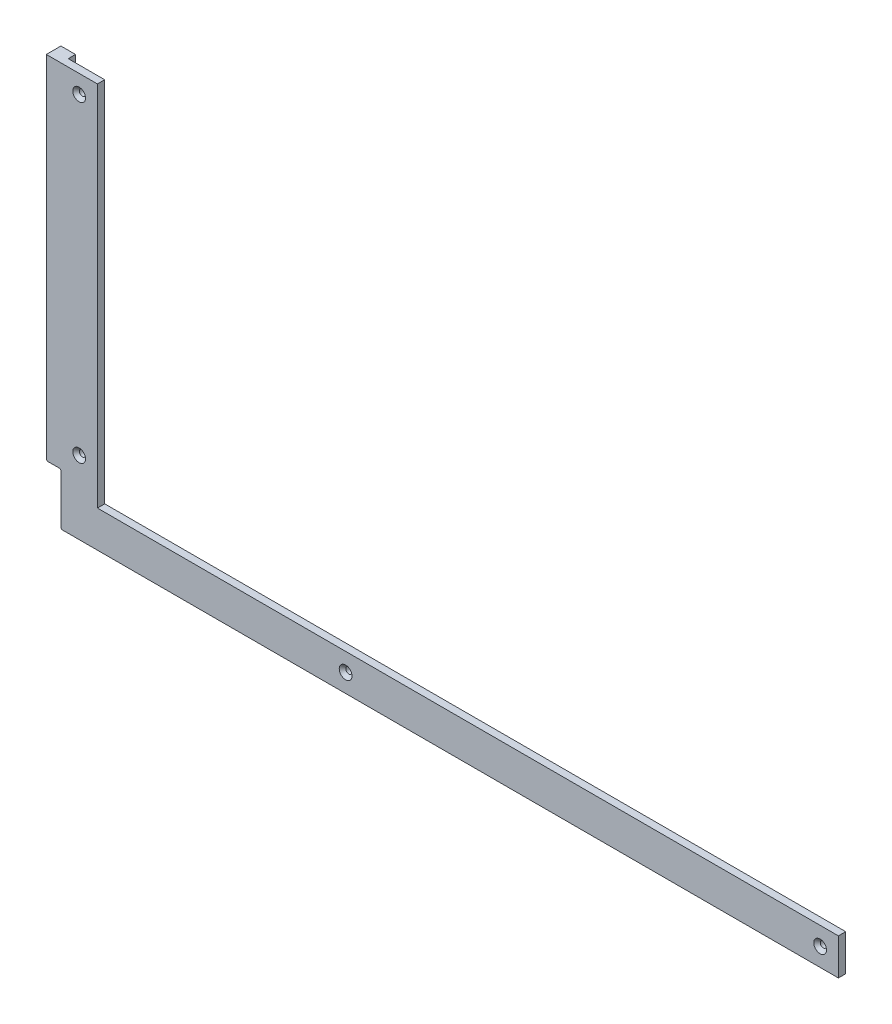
ISO-10303-21;
HEADER;
FILE_DESCRIPTION(('STEP AP214'),'2;1');
FILE_NAME('part.step','',(''),(''),'','','');
FILE_SCHEMA(('AUTOMOTIVE_DESIGN { 1 0 10303 214 1 1 1 1 }'));
ENDSEC;
DATA;
#1=APPLICATION_CONTEXT('core data for automotive mechanical design processes');
#2=APPLICATION_PROTOCOL_DEFINITION('international standard','automotive_design',2000,#1);
#3=PRODUCT_CONTEXT('',#1,'mechanical');
#4=PRODUCT('Part','Part','',(#3));
#5=PRODUCT_RELATED_PRODUCT_CATEGORY('part','',(#4));
#6=PRODUCT_DEFINITION_FORMATION('','',#4);
#7=PRODUCT_DEFINITION_CONTEXT('part definition',#1,'design');
#8=PRODUCT_DEFINITION('design','',#6,#7);
#9=PRODUCT_DEFINITION_SHAPE('','',#8);
#10=(LENGTH_UNIT() NAMED_UNIT(*) SI_UNIT(.MILLI.,.METRE.));
#11=(NAMED_UNIT(*) PLANE_ANGLE_UNIT() SI_UNIT($,.RADIAN.));
#12=(NAMED_UNIT(*) SI_UNIT($,.STERADIAN.) SOLID_ANGLE_UNIT());
#13=UNCERTAINTY_MEASURE_WITH_UNIT(LENGTH_MEASURE(1.E-05),#10,'distance_accuracy_value','');
#14=(GEOMETRIC_REPRESENTATION_CONTEXT(3) GLOBAL_UNCERTAINTY_ASSIGNED_CONTEXT((#13)) GLOBAL_UNIT_ASSIGNED_CONTEXT((#10,
#11,#12)) REPRESENTATION_CONTEXT('',''));
#15=CARTESIAN_POINT('',(0.,0.,0.));
#16=DIRECTION('',(0.,0.,1.));
#17=DIRECTION('',(1.,0.,0.));
#18=AXIS2_PLACEMENT_3D('',#15,#16,#17);
#19=CARTESIAN_POINT('',(0.,0.,8.));
#20=DIRECTION('',(0.,0.,-1.));
#21=DIRECTION('',(-1.,0.,0.));
#22=AXIS2_PLACEMENT_3D('',#19,#20,#21);
#23=PLANE('',#22);
#24=CARTESIAN_POINT('',(0.,-201.25,8.));
#25=DIRECTION('',(0.,0.,1.));
#26=DIRECTION('',(1.,0.,0.));
#27=AXIS2_PLACEMENT_3D('',#24,#25,#26);
#28=CIRCLE('',#27,3.5);
#29=CARTESIAN_POINT('',(3.5,-201.25,8.));
#30=VERTEX_POINT('',#29);
#31=EDGE_CURVE('E284',#30,#30,#28,.T.);
#32=ORIENTED_EDGE('',*,*,#31,.F.);
#33=EDGE_LOOP('',(#32));
#34=FACE_BOUND('',#33,.T.);
#35=CARTESIAN_POINT('',(-406.,0.,8.));
#36=DIRECTION('',(0.,0.,1.));
#37=DIRECTION('',(1.,0.,0.));
#38=AXIS2_PLACEMENT_3D('',#35,#36,#37);
#39=CIRCLE('',#38,3.5);
#40=CARTESIAN_POINT('',(-402.5,0.,8.));
#41=VERTEX_POINT('',#40);
#42=EDGE_CURVE('E275',#41,#41,#39,.T.);
#43=ORIENTED_EDGE('',*,*,#42,.F.);
#44=EDGE_LOOP('',(#43));
#45=FACE_BOUND('',#44,.T.);
#46=CARTESIAN_POINT('',(-406.,-171.25,8.));
#47=DIRECTION('',(0.,0.,1.));
#48=DIRECTION('',(1.,0.,0.));
#49=AXIS2_PLACEMENT_3D('',#46,#47,#48);
#50=CIRCLE('',#49,3.5);
#51=CARTESIAN_POINT('',(-402.5,-171.25,8.));
#52=VERTEX_POINT('',#51);
#53=EDGE_CURVE('E266',#52,#52,#50,.T.);
#54=ORIENTED_EDGE('',*,*,#53,.F.);
#55=EDGE_LOOP('',(#54));
#56=FACE_BOUND('',#55,.T.);
#57=CARTESIAN_POINT('',(-260.,-201.25,8.));
#58=DIRECTION('',(0.,0.,1.));
#59=DIRECTION('',(1.,0.,0.));
#60=AXIS2_PLACEMENT_3D('',#57,#58,#59);
#61=CIRCLE('',#60,3.5);
#62=CARTESIAN_POINT('',(-256.5,-201.25,8.));
#63=VERTEX_POINT('',#62);
#64=EDGE_CURVE('E257',#63,#63,#61,.T.);
#65=ORIENTED_EDGE('',*,*,#64,.F.);
#66=EDGE_LOOP('',(#65));
#67=FACE_BOUND('',#66,.T.);
#68=DIRECTION('',(0.,-1.,0.));
#69=VECTOR('',#68,1.);
#70=CARTESIAN_POINT('',(-424.,10.,8.));
#71=LINE('',#70,#69);
#72=CARTESIAN_POINT('',(-424.,10.,8.));
#73=VERTEX_POINT('',#72);
#74=CARTESIAN_POINT('',(-424.,-181.75,8.));
#75=VERTEX_POINT('',#74);
#76=EDGE_CURVE('E173',#73,#75,#71,.T.);
#77=ORIENTED_EDGE('',*,*,#76,.T.);
#78=CARTESIAN_POINT('',(-423.,-181.75,8.00000000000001));
#79=DIRECTION('',(0.,0.,-1.));
#80=DIRECTION('',(-1.,0.,0.));
#81=AXIS2_PLACEMENT_3D('',#78,#79,#80);
#82=CIRCLE('',#81,1.);
#83=CARTESIAN_POINT('',(-423.,-182.75,8.));
#84=VERTEX_POINT('',#83);
#85=EDGE_CURVE('E54',#75,#84,#82,.F.);
#86=ORIENTED_EDGE('',*,*,#85,.T.);
#87=DIRECTION('',(1.,0.,0.));
#88=VECTOR('',#87,1.);
#89=CARTESIAN_POINT('',(-416.,-182.75,8.));
#90=LINE('',#89,#88);
#91=CARTESIAN_POINT('',(-417.,-182.75,8.));
#92=VERTEX_POINT('',#91);
#93=EDGE_CURVE('E183',#84,#92,#90,.T.);
#94=ORIENTED_EDGE('',*,*,#93,.T.);
#95=CARTESIAN_POINT('',(-417.,-183.75,8.00000000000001));
#96=DIRECTION('',(0.,0.,-1.));
#97=DIRECTION('',(-1.,0.,0.));
#98=AXIS2_PLACEMENT_3D('',#95,#96,#97);
#99=CIRCLE('',#98,1.);
#100=CARTESIAN_POINT('',(-416.,-183.75,8.));
#101=VERTEX_POINT('',#100);
#102=EDGE_CURVE('E47',#92,#101,#99,.T.);
#103=ORIENTED_EDGE('',*,*,#102,.T.);
#104=DIRECTION('',(0.,-1.,0.));
#105=VECTOR('',#104,1.);
#106=CARTESIAN_POINT('',(-416.,-211.25,8.));
#107=LINE('',#106,#105);
#108=CARTESIAN_POINT('',(-416.,-210.25,8.));
#109=VERTEX_POINT('',#108);
#110=EDGE_CURVE('E326',#101,#109,#107,.T.);
#111=ORIENTED_EDGE('',*,*,#110,.T.);
#112=CARTESIAN_POINT('',(-415.,-210.25,8.));
#113=DIRECTION('',(0.,0.,-1.));
#114=DIRECTION('',(-1.,0.,0.));
#115=AXIS2_PLACEMENT_3D('',#112,#113,#114);
#116=CIRCLE('',#115,1.);
#117=CARTESIAN_POINT('',(-415.,-211.25,8.));
#118=VERTEX_POINT('',#117);
#119=EDGE_CURVE('E347',#109,#118,#116,.F.);
#120=ORIENTED_EDGE('',*,*,#119,.T.);
#121=DIRECTION('',(1.,0.,0.));
#122=VECTOR('',#121,1.);
#123=CARTESIAN_POINT('',(-416.,-211.25,8.));
#124=LINE('',#123,#122);
#125=CARTESIAN_POINT('',(10.,-211.25,8.00000000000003));
#126=VERTEX_POINT('',#125);
#127=EDGE_CURVE('E329',#118,#126,#124,.T.);
#128=ORIENTED_EDGE('',*,*,#127,.T.);
#129=DIRECTION('',(0.,1.,0.));
#130=VECTOR('',#129,1.);
#131=CARTESIAN_POINT('',(10.,-211.25,8.00000000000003));
#132=LINE('',#131,#130);
#133=CARTESIAN_POINT('',(10.,-191.25,8.00000000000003));
#134=VERTEX_POINT('',#133);
#135=EDGE_CURVE('E212',#126,#134,#132,.T.);
#136=ORIENTED_EDGE('',*,*,#135,.T.);
#137=DIRECTION('',(1.,0.,0.));
#138=VECTOR('',#137,1.);
#139=CARTESIAN_POINT('',(-396.,-191.25,8.));
#140=LINE('',#139,#138);
#141=CARTESIAN_POINT('',(-396.,-191.25,8.));
#142=VERTEX_POINT('',#141);
#143=EDGE_CURVE('E317',#142,#134,#140,.T.);
#144=ORIENTED_EDGE('',*,*,#143,.F.);
#145=DIRECTION('',(0.,-1.,0.));
#146=VECTOR('',#145,1.);
#147=CARTESIAN_POINT('',(-396.,-191.25,8.));
#148=LINE('',#147,#146);
#149=CARTESIAN_POINT('',(-396.,10.,7.99999999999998));
#150=VERTEX_POINT('',#149);
#151=EDGE_CURVE('E314',#150,#142,#148,.T.);
#152=ORIENTED_EDGE('',*,*,#151,.F.);
#153=DIRECTION('',(1.,0.,0.));
#154=VECTOR('',#153,1.);
#155=CARTESIAN_POINT('',(-416.,10.,7.99999999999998));
#156=LINE('',#155,#154);
#157=EDGE_CURVE('E236',#73,#150,#156,.T.);
#158=ORIENTED_EDGE('',*,*,#157,.F.);
#159=EDGE_LOOP('',(#77,#86,#94,#103,#111,#120,#128,#136,#144,#152,#158));
#160=FACE_BOUND('',#159,.T.);
#161=ADVANCED_FACE('F38',(#34,#45,#56,#67,#160),#23,.F.);
#162=CARTESIAN_POINT('',(0.,0.,0.));
#163=DIRECTION('',(0.,0.,-1.));
#164=DIRECTION('',(-1.,0.,0.));
#165=AXIS2_PLACEMENT_3D('',#162,#163,#164);
#166=PLANE('',#165);
#167=DIRECTION('',(1.,0.,0.));
#168=VECTOR('',#167,1.);
#169=CARTESIAN_POINT('',(-416.,-182.75,0.));
#170=LINE('',#169,#168);
#171=CARTESIAN_POINT('',(-423.,-182.75,0.));
#172=VERTEX_POINT('',#171);
#173=CARTESIAN_POINT('',(-417.,-182.75,0.));
#174=VERTEX_POINT('',#173);
#175=EDGE_CURVE('E166',#172,#174,#170,.T.);
#176=ORIENTED_EDGE('',*,*,#175,.F.);
#177=CARTESIAN_POINT('',(-423.,-181.75,0.));
#178=DIRECTION('',(0.,0.,-1.));
#179=DIRECTION('',(-1.,0.,0.));
#180=AXIS2_PLACEMENT_3D('',#177,#178,#179);
#181=CIRCLE('',#180,1.);
#182=CARTESIAN_POINT('',(-424.,-181.75,0.));
#183=VERTEX_POINT('',#182);
#184=EDGE_CURVE('E62',#172,#183,#181,.T.);
#185=ORIENTED_EDGE('',*,*,#184,.T.);
#186=DIRECTION('',(0.,-1.,0.));
#187=VECTOR('',#186,1.);
#188=CARTESIAN_POINT('',(-424.,10.,0.));
#189=LINE('',#188,#187);
#190=CARTESIAN_POINT('',(-424.,10.,0.));
#191=VERTEX_POINT('',#190);
#192=EDGE_CURVE('E157',#191,#183,#189,.T.);
#193=ORIENTED_EDGE('',*,*,#192,.F.);
#194=DIRECTION('',(-1.,0.,0.));
#195=VECTOR('',#194,1.);
#196=CARTESIAN_POINT('',(-416.,10.,0.));
#197=LINE('',#196,#195);
#198=CARTESIAN_POINT('',(-416.,10.,0.));
#199=VERTEX_POINT('',#198);
#200=EDGE_CURVE('E162',#199,#191,#197,.T.);
#201=ORIENTED_EDGE('',*,*,#200,.F.);
#202=DIRECTION('',(0.,1.,0.));
#203=VECTOR('',#202,1.);
#204=CARTESIAN_POINT('',(-416.,10.,0.));
#205=LINE('',#204,#203);
#206=CARTESIAN_POINT('',(-416.,-10.,0.));
#207=VERTEX_POINT('',#206);
#208=EDGE_CURVE('E191',#207,#199,#205,.T.);
#209=ORIENTED_EDGE('',*,*,#208,.F.);
#210=DIRECTION('',(1.,0.,0.));
#211=VECTOR('',#210,1.);
#212=CARTESIAN_POINT('',(-416.,-10.,0.));
#213=LINE('',#212,#211);
#214=CARTESIAN_POINT('',(-408.5,-10.,0.));
#215=VERTEX_POINT('',#214);
#216=EDGE_CURVE('E237',#207,#215,#213,.T.);
#217=ORIENTED_EDGE('',*,*,#216,.T.);
#218=DIRECTION('',(0.,1.,0.));
#219=VECTOR('',#218,1.);
#220=CARTESIAN_POINT('',(-408.5,203.75,0.));
#221=LINE('',#220,#219);
#222=CARTESIAN_POINT('',(-408.5,-203.75,0.));
#223=VERTEX_POINT('',#222);
#224=EDGE_CURVE('E297',#223,#215,#221,.T.);
#225=ORIENTED_EDGE('',*,*,#224,.F.);
#226=DIRECTION('',(-1.,0.,0.));
#227=VECTOR('',#226,1.);
#228=CARTESIAN_POINT('',(408.5,-203.75,0.));
#229=LINE('',#228,#227);
#230=CARTESIAN_POINT('',(-9.9999999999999,-203.75,0.));
#231=VERTEX_POINT('',#230);
#232=EDGE_CURVE('E302',#231,#223,#229,.T.);
#233=ORIENTED_EDGE('',*,*,#232,.F.);
#234=DIRECTION('',(0.,1.,0.));
#235=VECTOR('',#234,1.);
#236=CARTESIAN_POINT('',(-10.,-211.25,0.));
#237=LINE('',#236,#235);
#238=CARTESIAN_POINT('',(-10.,-211.25,0.));
#239=VERTEX_POINT('',#238);
#240=EDGE_CURVE('E211',#239,#231,#237,.T.);
#241=ORIENTED_EDGE('',*,*,#240,.F.);
#242=DIRECTION('',(1.,0.,0.));
#243=VECTOR('',#242,1.);
#244=CARTESIAN_POINT('',(-416.,-211.25,0.));
#245=LINE('',#244,#243);
#246=CARTESIAN_POINT('',(-415.,-211.25,0.));
#247=VERTEX_POINT('',#246);
#248=EDGE_CURVE('E330',#247,#239,#245,.T.);
#249=ORIENTED_EDGE('',*,*,#248,.F.);
#250=CARTESIAN_POINT('',(-415.,-210.25,0.));
#251=DIRECTION('',(0.,0.,-1.));
#252=DIRECTION('',(-1.,0.,0.));
#253=AXIS2_PLACEMENT_3D('',#250,#251,#252);
#254=CIRCLE('',#253,1.);
#255=CARTESIAN_POINT('',(-416.,-210.25,0.));
#256=VERTEX_POINT('',#255);
#257=EDGE_CURVE('E343',#247,#256,#254,.T.);
#258=ORIENTED_EDGE('',*,*,#257,.T.);
#259=DIRECTION('',(0.,-1.,0.));
#260=VECTOR('',#259,1.);
#261=CARTESIAN_POINT('',(-416.,-211.25,0.));
#262=LINE('',#261,#260);
#263=CARTESIAN_POINT('',(-416.,-183.75,0.));
#264=VERTEX_POINT('',#263);
#265=EDGE_CURVE('E325',#264,#256,#262,.T.);
#266=ORIENTED_EDGE('',*,*,#265,.F.);
#267=CARTESIAN_POINT('',(-417.,-183.75,0.));
#268=DIRECTION('',(0.,0.,-1.));
#269=DIRECTION('',(-1.,0.,0.));
#270=AXIS2_PLACEMENT_3D('',#267,#268,#269);
#271=CIRCLE('',#270,1.);
#272=EDGE_CURVE('E11',#264,#174,#271,.F.);
#273=ORIENTED_EDGE('',*,*,#272,.T.);
#274=EDGE_LOOP('',(#176,#185,#193,#201,#209,#217,#225,#233,#241,#249,#258,#266,#273));
#275=FACE_BOUND('',#274,.T.);
#276=ADVANCED_FACE('F159',(#275),#166,.T.);
#277=CARTESIAN_POINT('',(0.,0.,4.));
#278=DIRECTION('',(0.,0.,-1.));
#279=DIRECTION('',(-1.,0.,0.));
#280=AXIS2_PLACEMENT_3D('',#277,#278,#279);
#281=PLANE('',#280);
#282=DIRECTION('',(0.,1.,0.));
#283=VECTOR('',#282,1.);
#284=CARTESIAN_POINT('',(-396.,-191.25,4.));
#285=LINE('',#284,#283);
#286=CARTESIAN_POINT('',(-396.,-191.25,4.));
#287=VERTEX_POINT('',#286);
#288=CARTESIAN_POINT('',(-396.,10.,4.));
#289=VERTEX_POINT('',#288);
#290=EDGE_CURVE('E311',#287,#289,#285,.T.);
#291=ORIENTED_EDGE('',*,*,#290,.F.);
#292=DIRECTION('',(-1.,0.,0.));
#293=VECTOR('',#292,1.);
#294=CARTESIAN_POINT('',(-396.,-191.25,4.));
#295=LINE('',#294,#293);
#296=CARTESIAN_POINT('',(10.,-191.25,4.));
#297=VERTEX_POINT('',#296);
#298=EDGE_CURVE('E354',#297,#287,#295,.T.);
#299=ORIENTED_EDGE('',*,*,#298,.F.);
#300=DIRECTION('',(0.,1.,0.));
#301=VECTOR('',#300,1.);
#302=CARTESIAN_POINT('',(10.,-211.25,4.));
#303=LINE('',#302,#301);
#304=CARTESIAN_POINT('',(10.,-211.25,4.));
#305=VERTEX_POINT('',#304);
#306=EDGE_CURVE('E217',#305,#297,#303,.T.);
#307=ORIENTED_EDGE('',*,*,#306,.F.);
#308=DIRECTION('',(1.,0.,0.));
#309=VECTOR('',#308,1.);
#310=CARTESIAN_POINT('',(10.,-211.25,4.));
#311=LINE('',#310,#309);
#312=CARTESIAN_POINT('',(-10.,-211.25,4.));
#313=VERTEX_POINT('',#312);
#314=EDGE_CURVE('E203',#313,#305,#311,.T.);
#315=ORIENTED_EDGE('',*,*,#314,.F.);
#316=DIRECTION('',(0.,1.,0.));
#317=VECTOR('',#316,1.);
#318=CARTESIAN_POINT('',(-10.,-211.25,4.));
#319=LINE('',#318,#317);
#320=CARTESIAN_POINT('',(-10.,-203.75,4.));
#321=VERTEX_POINT('',#320);
#322=EDGE_CURVE('E220',#313,#321,#319,.T.);
#323=ORIENTED_EDGE('',*,*,#322,.T.);
#324=DIRECTION('',(-1.,0.,0.));
#325=VECTOR('',#324,1.);
#326=CARTESIAN_POINT('',(408.5,-203.75,4.));
#327=LINE('',#326,#325);
#328=CARTESIAN_POINT('',(-408.5,-203.75,4.));
#329=VERTEX_POINT('',#328);
#330=EDGE_CURVE('E293',#321,#329,#327,.T.);
#331=ORIENTED_EDGE('',*,*,#330,.T.);
#332=DIRECTION('',(0.,1.,0.));
#333=VECTOR('',#332,1.);
#334=CARTESIAN_POINT('',(-408.5,203.75,4.));
#335=LINE('',#334,#333);
#336=CARTESIAN_POINT('',(-408.5,-10.,4.));
#337=VERTEX_POINT('',#336);
#338=EDGE_CURVE('E296',#329,#337,#335,.T.);
#339=ORIENTED_EDGE('',*,*,#338,.T.);
#340=DIRECTION('',(1.,0.,0.));
#341=VECTOR('',#340,1.);
#342=CARTESIAN_POINT('',(-416.,-10.,4.));
#343=LINE('',#342,#341);
#344=CARTESIAN_POINT('',(-416.,-10.,4.));
#345=VERTEX_POINT('',#344);
#346=EDGE_CURVE('E242',#345,#337,#343,.T.);
#347=ORIENTED_EDGE('',*,*,#346,.F.);
#348=DIRECTION('',(0.,-1.,0.));
#349=VECTOR('',#348,1.);
#350=CARTESIAN_POINT('',(-416.,10.,4.));
#351=LINE('',#350,#349);
#352=CARTESIAN_POINT('',(-416.,10.,4.));
#353=VERTEX_POINT('',#352);
#354=EDGE_CURVE('E228',#353,#345,#351,.T.);
#355=ORIENTED_EDGE('',*,*,#354,.F.);
#356=DIRECTION('',(1.,0.,0.));
#357=VECTOR('',#356,1.);
#358=CARTESIAN_POINT('',(-416.,10.,4.));
#359=LINE('',#358,#357);
#360=EDGE_CURVE('E245',#353,#289,#359,.T.);
#361=ORIENTED_EDGE('',*,*,#360,.T.);
#362=EDGE_LOOP('',(#291,#299,#307,#315,#323,#331,#339,#347,#355,#361));
#363=FACE_BOUND('',#362,.T.);
#364=CARTESIAN_POINT('',(-260.,-201.25,4.));
#365=DIRECTION('',(0.,0.,-1.));
#366=DIRECTION('',(-1.,0.,0.));
#367=AXIS2_PLACEMENT_3D('',#364,#365,#366);
#368=CIRCLE('',#367,1.69999999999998);
#369=CARTESIAN_POINT('',(-261.7,-201.25,4.));
#370=VERTEX_POINT('',#369);
#371=EDGE_CURVE('E265',#370,#370,#368,.T.);
#372=ORIENTED_EDGE('',*,*,#371,.F.);
#373=EDGE_LOOP('',(#372));
#374=FACE_BOUND('',#373,.T.);
#375=CARTESIAN_POINT('',(-406.,-171.25,4.));
#376=DIRECTION('',(0.,0.,-1.));
#377=DIRECTION('',(-1.,0.,0.));
#378=AXIS2_PLACEMENT_3D('',#375,#376,#377);
#379=CIRCLE('',#378,1.69999999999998);
#380=CARTESIAN_POINT('',(-407.7,-171.25,4.));
#381=VERTEX_POINT('',#380);
#382=EDGE_CURVE('E274',#381,#381,#379,.T.);
#383=ORIENTED_EDGE('',*,*,#382,.F.);
#384=EDGE_LOOP('',(#383));
#385=FACE_BOUND('',#384,.T.);
#386=CARTESIAN_POINT('',(-406.,0.,4.));
#387=DIRECTION('',(0.,0.,-1.));
#388=DIRECTION('',(-1.,0.,0.));
#389=AXIS2_PLACEMENT_3D('',#386,#387,#388);
#390=CIRCLE('',#389,1.69999999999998);
#391=CARTESIAN_POINT('',(-407.7,0.,4.));
#392=VERTEX_POINT('',#391);
#393=EDGE_CURVE('E283',#392,#392,#390,.T.);
#394=ORIENTED_EDGE('',*,*,#393,.F.);
#395=EDGE_LOOP('',(#394));
#396=FACE_BOUND('',#395,.T.);
#397=CARTESIAN_POINT('',(0.,-201.25,4.));
#398=DIRECTION('',(0.,0.,-1.));
#399=DIRECTION('',(-1.,0.,0.));
#400=AXIS2_PLACEMENT_3D('',#397,#398,#399);
#401=CIRCLE('',#400,1.7);
#402=CARTESIAN_POINT('',(-1.7,-201.25,4.));
#403=VERTEX_POINT('',#402);
#404=EDGE_CURVE('E292',#403,#403,#401,.T.);
#405=ORIENTED_EDGE('',*,*,#404,.F.);
#406=EDGE_LOOP('',(#405));
#407=FACE_BOUND('',#406,.T.);
#408=ADVANCED_FACE('F418',(#363,#374,#385,#396,#407),#281,.T.);
#409=CARTESIAN_POINT('',(-396.,-191.25,8.));
#410=DIRECTION('',(1.,0.,0.));
#411=DIRECTION('',(0.,0.,-1.));
#412=AXIS2_PLACEMENT_3D('',#409,#410,#411);
#413=PLANE('',#412);
#414=DIRECTION('',(0.,0.,-1.));
#415=VECTOR('',#414,1.);
#416=CARTESIAN_POINT('',(-396.,10.,7.99999999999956));
#417=LINE('',#416,#415);
#418=EDGE_CURVE('E241',#150,#289,#417,.T.);
#419=ORIENTED_EDGE('',*,*,#418,.F.);
#420=ORIENTED_EDGE('',*,*,#151,.T.);
#421=DIRECTION('',(0.,0.,-1.));
#422=VECTOR('',#421,1.);
#423=CARTESIAN_POINT('',(-396.,-191.25,8.));
#424=LINE('',#423,#422);
#425=EDGE_CURVE('E321',#142,#287,#424,.T.);
#426=ORIENTED_EDGE('',*,*,#425,.T.);
#427=ORIENTED_EDGE('',*,*,#290,.T.);
#428=EDGE_LOOP('',(#419,#420,#426,#427));
#429=FACE_BOUND('',#428,.T.);
#430=ADVANCED_FACE('F413',(#429),#413,.T.);
#431=CARTESIAN_POINT('',(-396.,-191.25,8.));
#432=DIRECTION('',(0.,1.,0.));
#433=DIRECTION('',(0.,0.,1.));
#434=AXIS2_PLACEMENT_3D('',#431,#432,#433);
#435=PLANE('',#434);
#436=DIRECTION('',(0.,0.,1.));
#437=VECTOR('',#436,1.);
#438=CARTESIAN_POINT('',(10.,-191.25,7.99999999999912));
#439=LINE('',#438,#437);
#440=EDGE_CURVE('E216',#297,#134,#439,.T.);
#441=ORIENTED_EDGE('',*,*,#440,.F.);
#442=ORIENTED_EDGE('',*,*,#298,.T.);
#443=ORIENTED_EDGE('',*,*,#425,.F.);
#444=ORIENTED_EDGE('',*,*,#143,.T.);
#445=EDGE_LOOP('',(#441,#442,#443,#444));
#446=FACE_BOUND('',#445,.T.);
#447=ADVANCED_FACE('F446',(#446),#435,.T.);
#448=CARTESIAN_POINT('',(-416.,-211.25,8.));
#449=DIRECTION('',(1.,0.,0.));
#450=DIRECTION('',(0.,0.,-1.));
#451=AXIS2_PLACEMENT_3D('',#448,#449,#450);
#452=PLANE('',#451);
#453=ORIENTED_EDGE('',*,*,#110,.F.);
#454=DIRECTION('',(0.,0.,1.));
#455=VECTOR('',#454,1.);
#456=CARTESIAN_POINT('',(-416.,-183.75,8.));
#457=LINE('',#456,#455);
#458=EDGE_CURVE('E380',#101,#264,#457,.F.);
#459=ORIENTED_EDGE('',*,*,#458,.T.);
#460=ORIENTED_EDGE('',*,*,#265,.T.);
#461=DIRECTION('',(0.,0.,-1.));
#462=VECTOR('',#461,1.);
#463=CARTESIAN_POINT('',(-416.,-210.25,8.));
#464=LINE('',#463,#462);
#465=EDGE_CURVE('E334',#256,#109,#464,.F.);
#466=ORIENTED_EDGE('',*,*,#465,.T.);
#467=EDGE_LOOP('',(#453,#459,#460,#466));
#468=FACE_BOUND('',#467,.T.);
#469=ADVANCED_FACE('F398',(#468),#452,.F.);
#470=CARTESIAN_POINT('',(-416.,-211.25,8.));
#471=DIRECTION('',(0.,1.,0.));
#472=DIRECTION('',(0.,0.,1.));
#473=AXIS2_PLACEMENT_3D('',#470,#471,#472);
#474=PLANE('',#473);
#475=ORIENTED_EDGE('',*,*,#314,.T.);
#476=DIRECTION('',(0.,0.,1.));
#477=VECTOR('',#476,1.);
#478=CARTESIAN_POINT('',(10.,-211.25,8.00000000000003));
#479=LINE('',#478,#477);
#480=EDGE_CURVE('E207',#305,#126,#479,.T.);
#481=ORIENTED_EDGE('',*,*,#480,.T.);
#482=ORIENTED_EDGE('',*,*,#127,.F.);
#483=DIRECTION('',(0.,0.,-1.));
#484=VECTOR('',#483,1.);
#485=CARTESIAN_POINT('',(-415.,-211.25,8.));
#486=LINE('',#485,#484);
#487=EDGE_CURVE('E350',#118,#247,#486,.T.);
#488=ORIENTED_EDGE('',*,*,#487,.T.);
#489=ORIENTED_EDGE('',*,*,#248,.T.);
#490=DIRECTION('',(0.,0.,1.));
#491=VECTOR('',#490,1.);
#492=CARTESIAN_POINT('',(-10.,-211.25,4.));
#493=LINE('',#492,#491);
#494=EDGE_CURVE('E199',#239,#313,#493,.T.);
#495=ORIENTED_EDGE('',*,*,#494,.T.);
#496=EDGE_LOOP('',(#475,#481,#482,#488,#489,#495));
#497=FACE_BOUND('',#496,.T.);
#498=ADVANCED_FACE('F437',(#497),#474,.F.);
#499=CARTESIAN_POINT('',(-415.,-210.25,8.));
#500=DIRECTION('',(0.,0.,-1.));
#501=DIRECTION('',(-1.,0.,0.));
#502=AXIS2_PLACEMENT_3D('',#499,#500,#501);
#503=CYLINDRICAL_SURFACE('',#502,1.);
#504=ORIENTED_EDGE('',*,*,#119,.F.);
#505=ORIENTED_EDGE('',*,*,#465,.F.);
#506=ORIENTED_EDGE('',*,*,#257,.F.);
#507=ORIENTED_EDGE('',*,*,#487,.F.);
#508=EDGE_LOOP('',(#504,#505,#506,#507));
#509=FACE_BOUND('',#508,.T.);
#510=ADVANCED_FACE('F441',(#509),#503,.T.);
#511=CARTESIAN_POINT('',(-408.5,203.75,4.));
#512=DIRECTION('',(-1.,0.,0.));
#513=DIRECTION('',(0.,-1.,0.));
#514=AXIS2_PLACEMENT_3D('',#511,#512,#513);
#515=PLANE('',#514);
#516=ORIENTED_EDGE('',*,*,#224,.T.);
#517=DIRECTION('',(0.,0.,1.));
#518=VECTOR('',#517,1.);
#519=CARTESIAN_POINT('',(-408.5,-10.,4.00000000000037));
#520=LINE('',#519,#518);
#521=EDGE_CURVE('E253',#215,#337,#520,.T.);
#522=ORIENTED_EDGE('',*,*,#521,.T.);
#523=ORIENTED_EDGE('',*,*,#338,.F.);
#524=DIRECTION('',(0.,0.,-1.));
#525=VECTOR('',#524,1.);
#526=CARTESIAN_POINT('',(-408.5,-203.75,4.));
#527=LINE('',#526,#525);
#528=EDGE_CURVE('E301',#329,#223,#527,.T.);
#529=ORIENTED_EDGE('',*,*,#528,.T.);
#530=EDGE_LOOP('',(#516,#522,#523,#529));
#531=FACE_BOUND('',#530,.T.);
#532=ADVANCED_FACE('F427',(#531),#515,.F.);
#533=CARTESIAN_POINT('',(408.5,-203.75,4.));
#534=DIRECTION('',(0.,-1.,0.));
#535=DIRECTION('',(0.,0.,-1.));
#536=AXIS2_PLACEMENT_3D('',#533,#534,#535);
#537=PLANE('',#536);
#538=ORIENTED_EDGE('',*,*,#330,.F.);
#539=DIRECTION('',(0.,0.,-1.));
#540=VECTOR('',#539,1.);
#541=CARTESIAN_POINT('',(-10.,-203.75,4.00000000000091));
#542=LINE('',#541,#540);
#543=EDGE_CURVE('E357',#321,#231,#542,.T.);
#544=ORIENTED_EDGE('',*,*,#543,.T.);
#545=ORIENTED_EDGE('',*,*,#232,.T.);
#546=ORIENTED_EDGE('',*,*,#528,.F.);
#547=EDGE_LOOP('',(#538,#544,#545,#546));
#548=FACE_BOUND('',#547,.T.);
#549=ADVANCED_FACE('F432',(#548),#537,.F.);
#550=CARTESIAN_POINT('',(0.,-201.25,8.));
#551=DIRECTION('',(0.,0.,1.));
#552=DIRECTION('',(1.,0.,0.));
#553=AXIS2_PLACEMENT_3D('',#550,#551,#552);
#554=CYLINDRICAL_SURFACE('',#553,1.7);
#555=ORIENTED_EDGE('',*,*,#404,.T.);
#556=EDGE_LOOP('',(#555));
#557=FACE_BOUND('',#556,.T.);
#558=CARTESIAN_POINT('',(0.,-201.25,6.2));
#559=DIRECTION('',(0.,0.,1.));
#560=DIRECTION('',(1.,0.,0.));
#561=AXIS2_PLACEMENT_3D('',#558,#559,#560);
#562=CIRCLE('',#561,1.7);
#563=CARTESIAN_POINT('',(1.7,-201.25,6.2));
#564=VERTEX_POINT('',#563);
#565=EDGE_CURVE('E288',#564,#564,#562,.T.);
#566=ORIENTED_EDGE('',*,*,#565,.T.);
#567=EDGE_LOOP('',(#566));
#568=FACE_BOUND('',#567,.T.);
#569=ADVANCED_FACE('F593',(#557,#568),#554,.F.);
#570=CARTESIAN_POINT('',(0.,-201.25,8.));
#571=DIRECTION('',(0.,0.,1.));
#572=DIRECTION('',(1.,0.,0.));
#573=AXIS2_PLACEMENT_3D('',#570,#571,#572);
#574=CONICAL_SURFACE('',#573,3.5,0.785398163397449);
#575=ORIENTED_EDGE('',*,*,#565,.F.);
#576=EDGE_LOOP('',(#575));
#577=FACE_BOUND('',#576,.T.);
#578=ORIENTED_EDGE('',*,*,#31,.T.);
#579=EDGE_LOOP('',(#578));
#580=FACE_BOUND('',#579,.T.);
#581=ADVANCED_FACE('F583',(#577,#580),#574,.F.);
#582=CARTESIAN_POINT('',(-406.,0.,8.));
#583=DIRECTION('',(0.,0.,1.));
#584=DIRECTION('',(1.,0.,0.));
#585=AXIS2_PLACEMENT_3D('',#582,#583,#584);
#586=CYLINDRICAL_SURFACE('',#585,1.69999999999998);
#587=ORIENTED_EDGE('',*,*,#393,.T.);
#588=EDGE_LOOP('',(#587));
#589=FACE_BOUND('',#588,.T.);
#590=CARTESIAN_POINT('',(-406.,0.,6.2));
#591=DIRECTION('',(0.,0.,1.));
#592=DIRECTION('',(1.,0.,0.));
#593=AXIS2_PLACEMENT_3D('',#590,#591,#592);
#594=CIRCLE('',#593,1.69999999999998);
#595=CARTESIAN_POINT('',(-404.3,0.,6.2));
#596=VERTEX_POINT('',#595);
#597=EDGE_CURVE('E279',#596,#596,#594,.T.);
#598=ORIENTED_EDGE('',*,*,#597,.T.);
#599=EDGE_LOOP('',(#598));
#600=FACE_BOUND('',#599,.T.);
#601=ADVANCED_FACE('F573',(#589,#600),#586,.F.);
#602=CARTESIAN_POINT('',(-406.,0.,8.));
#603=DIRECTION('',(0.,0.,1.));
#604=DIRECTION('',(1.,0.,0.));
#605=AXIS2_PLACEMENT_3D('',#602,#603,#604);
#606=CONICAL_SURFACE('',#605,3.5,0.785398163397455);
#607=ORIENTED_EDGE('',*,*,#597,.F.);
#608=EDGE_LOOP('',(#607));
#609=FACE_BOUND('',#608,.T.);
#610=ORIENTED_EDGE('',*,*,#42,.T.);
#611=EDGE_LOOP('',(#610));
#612=FACE_BOUND('',#611,.T.);
#613=ADVANCED_FACE('F563',(#609,#612),#606,.F.);
#614=CARTESIAN_POINT('',(-406.,-171.25,8.));
#615=DIRECTION('',(0.,0.,1.));
#616=DIRECTION('',(1.,0.,0.));
#617=AXIS2_PLACEMENT_3D('',#614,#615,#616);
#618=CYLINDRICAL_SURFACE('',#617,1.69999999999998);
#619=ORIENTED_EDGE('',*,*,#382,.T.);
#620=EDGE_LOOP('',(#619));
#621=FACE_BOUND('',#620,.T.);
#622=CARTESIAN_POINT('',(-406.,-171.25,6.2));
#623=DIRECTION('',(0.,0.,1.));
#624=DIRECTION('',(1.,0.,0.));
#625=AXIS2_PLACEMENT_3D('',#622,#623,#624);
#626=CIRCLE('',#625,1.69999999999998);
#627=CARTESIAN_POINT('',(-404.3,-171.25,6.2));
#628=VERTEX_POINT('',#627);
#629=EDGE_CURVE('E270',#628,#628,#626,.T.);
#630=ORIENTED_EDGE('',*,*,#629,.T.);
#631=EDGE_LOOP('',(#630));
#632=FACE_BOUND('',#631,.T.);
#633=ADVANCED_FACE('F553',(#621,#632),#618,.F.);
#634=CARTESIAN_POINT('',(-406.,-171.25,8.));
#635=DIRECTION('',(0.,0.,1.));
#636=DIRECTION('',(1.,0.,0.));
#637=AXIS2_PLACEMENT_3D('',#634,#635,#636);
#638=CONICAL_SURFACE('',#637,3.5,0.785398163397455);
#639=ORIENTED_EDGE('',*,*,#629,.F.);
#640=EDGE_LOOP('',(#639));
#641=FACE_BOUND('',#640,.T.);
#642=ORIENTED_EDGE('',*,*,#53,.T.);
#643=EDGE_LOOP('',(#642));
#644=FACE_BOUND('',#643,.T.);
#645=ADVANCED_FACE('F543',(#641,#644),#638,.F.);
#646=CARTESIAN_POINT('',(-260.,-201.25,8.));
#647=DIRECTION('',(0.,0.,1.));
#648=DIRECTION('',(1.,0.,0.));
#649=AXIS2_PLACEMENT_3D('',#646,#647,#648);
#650=CYLINDRICAL_SURFACE('',#649,1.69999999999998);
#651=ORIENTED_EDGE('',*,*,#371,.T.);
#652=EDGE_LOOP('',(#651));
#653=FACE_BOUND('',#652,.T.);
#654=CARTESIAN_POINT('',(-260.,-201.25,6.2));
#655=DIRECTION('',(0.,0.,1.));
#656=DIRECTION('',(1.,0.,0.));
#657=AXIS2_PLACEMENT_3D('',#654,#655,#656);
#658=CIRCLE('',#657,1.69999999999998);
#659=CARTESIAN_POINT('',(-258.3,-201.25,6.2));
#660=VERTEX_POINT('',#659);
#661=EDGE_CURVE('E261',#660,#660,#658,.T.);
#662=ORIENTED_EDGE('',*,*,#661,.T.);
#663=EDGE_LOOP('',(#662));
#664=FACE_BOUND('',#663,.T.);
#665=ADVANCED_FACE('F532',(#653,#664),#650,.F.);
#666=CARTESIAN_POINT('',(-260.,-201.25,8.));
#667=DIRECTION('',(0.,0.,1.));
#668=DIRECTION('',(1.,0.,0.));
#669=AXIS2_PLACEMENT_3D('',#666,#667,#668);
#670=CONICAL_SURFACE('',#669,3.5,0.785398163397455);
#671=ORIENTED_EDGE('',*,*,#661,.F.);
#672=EDGE_LOOP('',(#671));
#673=FACE_BOUND('',#672,.T.);
#674=ORIENTED_EDGE('',*,*,#64,.T.);
#675=EDGE_LOOP('',(#674));
#676=FACE_BOUND('',#675,.T.);
#677=ADVANCED_FACE('F523',(#673,#676),#670,.F.);
#678=CARTESIAN_POINT('',(-416.,-10.,4.));
#679=DIRECTION('',(0.,-1.,0.));
#680=DIRECTION('',(0.,0.,-1.));
#681=AXIS2_PLACEMENT_3D('',#678,#679,#680);
#682=PLANE('',#681);
#683=ORIENTED_EDGE('',*,*,#216,.F.);
#684=DIRECTION('',(0.,0.,-1.));
#685=VECTOR('',#684,1.);
#686=CARTESIAN_POINT('',(-416.,-10.,4.));
#687=LINE('',#686,#685);
#688=EDGE_CURVE('E232',#345,#207,#687,.T.);
#689=ORIENTED_EDGE('',*,*,#688,.F.);
#690=ORIENTED_EDGE('',*,*,#346,.T.);
#691=ORIENTED_EDGE('',*,*,#521,.F.);
#692=EDGE_LOOP('',(#683,#689,#690,#691));
#693=FACE_BOUND('',#692,.T.);
#694=ADVANCED_FACE('F513',(#693),#682,.F.);
#695=CARTESIAN_POINT('',(-416.,10.,7.99999999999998));
#696=DIRECTION('',(0.,-1.,0.));
#697=DIRECTION('',(0.,0.,-1.));
#698=AXIS2_PLACEMENT_3D('',#695,#696,#697);
#699=PLANE('',#698);
#700=ORIENTED_EDGE('',*,*,#418,.T.);
#701=ORIENTED_EDGE('',*,*,#360,.F.);
#702=DIRECTION('',(0.,0.,1.));
#703=VECTOR('',#702,1.);
#704=CARTESIAN_POINT('',(-416.,10.,-192.915946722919));
#705=LINE('',#704,#703);
#706=EDGE_CURVE('E181',#199,#353,#705,.T.);
#707=ORIENTED_EDGE('',*,*,#706,.F.);
#708=ORIENTED_EDGE('',*,*,#200,.T.);
#709=DIRECTION('',(0.,0.,1.));
#710=VECTOR('',#709,1.);
#711=CARTESIAN_POINT('',(-424.,10.,-192.915946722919));
#712=LINE('',#711,#710);
#713=EDGE_CURVE('E167',#191,#73,#712,.T.);
#714=ORIENTED_EDGE('',*,*,#713,.T.);
#715=ORIENTED_EDGE('',*,*,#157,.T.);
#716=EDGE_LOOP('',(#700,#701,#707,#708,#714,#715));
#717=FACE_BOUND('',#716,.T.);
#718=ADVANCED_FACE('F178',(#717),#699,.F.);
#719=CARTESIAN_POINT('',(-10.,-211.25,4.));
#720=DIRECTION('',(-1.,0.,0.));
#721=DIRECTION('',(0.,0.,1.));
#722=AXIS2_PLACEMENT_3D('',#719,#720,#721);
#723=PLANE('',#722);
#724=ORIENTED_EDGE('',*,*,#322,.F.);
#725=ORIENTED_EDGE('',*,*,#494,.F.);
#726=ORIENTED_EDGE('',*,*,#240,.T.);
#727=ORIENTED_EDGE('',*,*,#543,.F.);
#728=EDGE_LOOP('',(#724,#725,#726,#727));
#729=FACE_BOUND('',#728,.T.);
#730=ADVANCED_FACE('F450',(#729),#723,.F.);
#731=CARTESIAN_POINT('',(10.,-211.25,8.00000000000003));
#732=DIRECTION('',(-1.,0.,0.));
#733=DIRECTION('',(0.,0.,1.));
#734=AXIS2_PLACEMENT_3D('',#731,#732,#733);
#735=PLANE('',#734);
#736=ORIENTED_EDGE('',*,*,#440,.T.);
#737=ORIENTED_EDGE('',*,*,#135,.F.);
#738=ORIENTED_EDGE('',*,*,#480,.F.);
#739=ORIENTED_EDGE('',*,*,#306,.T.);
#740=EDGE_LOOP('',(#736,#737,#738,#739));
#741=FACE_BOUND('',#740,.T.);
#742=ADVANCED_FACE('F448',(#741),#735,.F.);
#743=CARTESIAN_POINT('',(-424.,10.,-192.915946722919));
#744=DIRECTION('',(-1.,0.,0.));
#745=DIRECTION('',(0.,0.,1.));
#746=AXIS2_PLACEMENT_3D('',#743,#744,#745);
#747=PLANE('',#746);
#748=ORIENTED_EDGE('',*,*,#192,.T.);
#749=DIRECTION('',(0.,0.,1.));
#750=VECTOR('',#749,1.);
#751=CARTESIAN_POINT('',(-424.,-181.75,-192.915946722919));
#752=LINE('',#751,#750);
#753=EDGE_CURVE('E383',#183,#75,#752,.T.);
#754=ORIENTED_EDGE('',*,*,#753,.T.);
#755=ORIENTED_EDGE('',*,*,#76,.F.);
#756=ORIENTED_EDGE('',*,*,#713,.F.);
#757=EDGE_LOOP('',(#748,#754,#755,#756));
#758=FACE_BOUND('',#757,.T.);
#759=ADVANCED_FACE('F171',(#758),#747,.T.);
#760=CARTESIAN_POINT('',(-416.,-182.75,-192.915946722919));
#761=DIRECTION('',(0.,-1.,0.));
#762=DIRECTION('',(0.,0.,-1.));
#763=AXIS2_PLACEMENT_3D('',#760,#761,#762);
#764=PLANE('',#763);
#765=ORIENTED_EDGE('',*,*,#175,.T.);
#766=DIRECTION('',(0.,0.,1.));
#767=VECTOR('',#766,1.);
#768=CARTESIAN_POINT('',(-417.,-182.75,-192.915946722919));
#769=LINE('',#768,#767);
#770=EDGE_CURVE('E376',#174,#92,#769,.T.);
#771=ORIENTED_EDGE('',*,*,#770,.T.);
#772=ORIENTED_EDGE('',*,*,#93,.F.);
#773=DIRECTION('',(0.,0.,1.));
#774=VECTOR('',#773,1.);
#775=CARTESIAN_POINT('',(-423.,-182.75,-192.915946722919));
#776=LINE('',#775,#774);
#777=EDGE_CURVE('E373',#84,#172,#776,.F.);
#778=ORIENTED_EDGE('',*,*,#777,.T.);
#779=EDGE_LOOP('',(#765,#771,#772,#778));
#780=FACE_BOUND('',#779,.T.);
#781=ADVANCED_FACE('F405',(#780),#764,.T.);
#782=CARTESIAN_POINT('',(-416.,10.,-192.915946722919));
#783=DIRECTION('',(1.,0.,0.));
#784=DIRECTION('',(0.,0.,-1.));
#785=AXIS2_PLACEMENT_3D('',#782,#783,#784);
#786=PLANE('',#785);
#787=ORIENTED_EDGE('',*,*,#706,.T.);
#788=ORIENTED_EDGE('',*,*,#354,.T.);
#789=ORIENTED_EDGE('',*,*,#688,.T.);
#790=ORIENTED_EDGE('',*,*,#208,.T.);
#791=EDGE_LOOP('',(#787,#788,#789,#790));
#792=FACE_BOUND('',#791,.T.);
#793=ADVANCED_FACE('F421',(#792),#786,.T.);
#794=CARTESIAN_POINT('',(-417.,-183.75,-192.915946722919));
#795=DIRECTION('',(0.,0.,1.));
#796=DIRECTION('',(1.,0.,0.));
#797=AXIS2_PLACEMENT_3D('',#794,#795,#796);
#798=CYLINDRICAL_SURFACE('',#797,1.);
#799=ORIENTED_EDGE('',*,*,#272,.F.);
#800=ORIENTED_EDGE('',*,*,#458,.F.);
#801=ORIENTED_EDGE('',*,*,#102,.F.);
#802=ORIENTED_EDGE('',*,*,#770,.F.);
#803=EDGE_LOOP('',(#799,#800,#801,#802));
#804=FACE_BOUND('',#803,.T.);
#805=ADVANCED_FACE('F403',(#804),#798,.F.);
#806=CARTESIAN_POINT('',(-423.,-181.75,-192.915946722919));
#807=DIRECTION('',(0.,0.,1.));
#808=DIRECTION('',(1.,0.,0.));
#809=AXIS2_PLACEMENT_3D('',#806,#807,#808);
#810=CYLINDRICAL_SURFACE('',#809,1.);
#811=ORIENTED_EDGE('',*,*,#184,.F.);
#812=ORIENTED_EDGE('',*,*,#777,.F.);
#813=ORIENTED_EDGE('',*,*,#85,.F.);
#814=ORIENTED_EDGE('',*,*,#753,.F.);
#815=EDGE_LOOP('',(#811,#812,#813,#814));
#816=FACE_BOUND('',#815,.T.);
#817=ADVANCED_FACE('F40',(#816),#810,.T.);
#818=CLOSED_SHELL('',(#161,#276,#408,#430,#447,#469,#498,#510,#532,#549,#569,#581,#601,#613,
#633,#645,#665,#677,#694,#718,#730,#742,#759,#781,#793,#805,#817));
#819=MANIFOLD_SOLID_BREP('B2',#818);
#820=ADVANCED_BREP_SHAPE_REPRESENTATION('',(#18,#819),#14);
#821=SHAPE_DEFINITION_REPRESENTATION(#9,#820);
ENDSEC;
END-ISO-10303-21;
